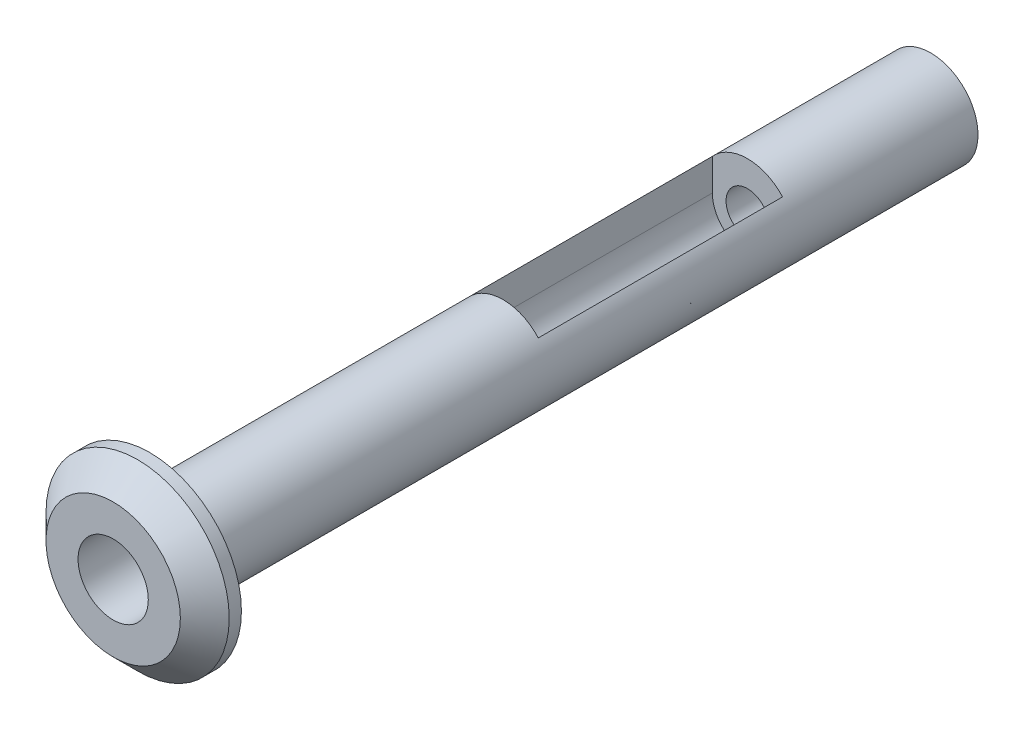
ISO-10303-21;
HEADER;
FILE_DESCRIPTION(('STEP AP214'),'2;1');
FILE_NAME('part.step','',(''),(''),'','','');
FILE_SCHEMA(('AUTOMOTIVE_DESIGN { 1 0 10303 214 1 1 1 1 }'));
ENDSEC;
DATA;
#1=APPLICATION_CONTEXT('core data for automotive mechanical design processes');
#2=APPLICATION_PROTOCOL_DEFINITION('international standard','automotive_design',2000,#1);
#3=PRODUCT_CONTEXT('',#1,'mechanical');
#4=PRODUCT('Part','Part','',(#3));
#5=PRODUCT_RELATED_PRODUCT_CATEGORY('part','',(#4));
#6=PRODUCT_DEFINITION_FORMATION('','',#4);
#7=PRODUCT_DEFINITION_CONTEXT('part definition',#1,'design');
#8=PRODUCT_DEFINITION('design','',#6,#7);
#9=PRODUCT_DEFINITION_SHAPE('','',#8);
#10=(LENGTH_UNIT() NAMED_UNIT(*) SI_UNIT(.MILLI.,.METRE.));
#11=(NAMED_UNIT(*) PLANE_ANGLE_UNIT() SI_UNIT($,.RADIAN.));
#12=(NAMED_UNIT(*) SI_UNIT($,.STERADIAN.) SOLID_ANGLE_UNIT());
#13=UNCERTAINTY_MEASURE_WITH_UNIT(LENGTH_MEASURE(1.E-05),#10,'distance_accuracy_value','');
#14=(GEOMETRIC_REPRESENTATION_CONTEXT(3) GLOBAL_UNCERTAINTY_ASSIGNED_CONTEXT((#13)) GLOBAL_UNIT_ASSIGNED_CONTEXT((#10,
#11,#12)) REPRESENTATION_CONTEXT('',''));
#15=CARTESIAN_POINT('',(0.,0.,0.));
#16=DIRECTION('',(0.,0.,1.));
#17=DIRECTION('',(1.,0.,0.));
#18=AXIS2_PLACEMENT_3D('',#15,#16,#17);
#19=CARTESIAN_POINT('',(0.,0.,-73.5617279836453));
#20=DIRECTION('',(0.,0.,1.));
#21=DIRECTION('',(1.,0.,0.));
#22=AXIS2_PLACEMENT_3D('',#19,#20,#21);
#23=CYLINDRICAL_SURFACE('',#22,2.875);
#24=CARTESIAN_POINT('',(0.,0.,1.5));
#25=DIRECTION('',(0.,0.,1.));
#26=DIRECTION('',(1.,0.,0.));
#27=AXIS2_PLACEMENT_3D('',#24,#25,#26);
#28=CIRCLE('',#27,2.875);
#29=CARTESIAN_POINT('',(2.875,0.,1.5));
#30=VERTEX_POINT('',#29);
#31=EDGE_CURVE('E97',#30,#30,#28,.T.);
#32=ORIENTED_EDGE('',*,*,#31,.T.);
#33=EDGE_LOOP('',(#32));
#34=FACE_BOUND('',#33,.T.);
#35=DIRECTION('',(0.,0.,-1.));
#36=VECTOR('',#35,1.);
#37=CARTESIAN_POINT('',(-2.875,0.,-30.43));
#38=LINE('',#37,#36);
#39=CARTESIAN_POINT('',(-2.875,0.,-30.43));
#40=VERTEX_POINT('',#39);
#41=CARTESIAN_POINT('',(-2.875,0.,-50.43));
#42=VERTEX_POINT('',#41);
#43=EDGE_CURVE('E64',#40,#42,#38,.T.);
#44=ORIENTED_EDGE('',*,*,#43,.F.);
#45=CARTESIAN_POINT('',(0.,0.,-30.43));
#46=DIRECTION('',(0.,0.,1.));
#47=DIRECTION('',(1.,0.,0.));
#48=AXIS2_PLACEMENT_3D('',#45,#46,#47);
#49=CIRCLE('',#48,2.875);
#50=CARTESIAN_POINT('',(2.875,0.,-30.43));
#51=VERTEX_POINT('',#50);
#52=EDGE_CURVE('E12',#40,#51,#49,.F.);
#53=ORIENTED_EDGE('',*,*,#52,.T.);
#54=DIRECTION('',(0.,0.,-1.));
#55=VECTOR('',#54,1.);
#56=CARTESIAN_POINT('',(2.875,0.,-30.43));
#57=LINE('',#56,#55);
#58=CARTESIAN_POINT('',(2.875,0.,-50.43));
#59=VERTEX_POINT('',#58);
#60=EDGE_CURVE('E110',#51,#59,#57,.T.);
#61=ORIENTED_EDGE('',*,*,#60,.T.);
#62=CARTESIAN_POINT('',(0.,0.,-50.43));
#63=DIRECTION('',(0.,0.,-1.));
#64=DIRECTION('',(-1.,0.,0.));
#65=AXIS2_PLACEMENT_3D('',#62,#63,#64);
#66=CIRCLE('',#65,2.875);
#67=EDGE_CURVE('E116',#42,#59,#66,.F.);
#68=ORIENTED_EDGE('',*,*,#67,.F.);
#69=EDGE_LOOP('',(#44,#53,#61,#68));
#70=FACE_BOUND('',#69,.T.);
#71=ADVANCED_FACE('F40',(#34,#70),#23,.F.);
#72=CARTESIAN_POINT('',(0.,0.,-1.5));
#73=DIRECTION('',(0.,0.,1.));
#74=DIRECTION('',(1.,0.,0.));
#75=AXIS2_PLACEMENT_3D('',#72,#73,#74);
#76=PLANE('',#75);
#77=CARTESIAN_POINT('',(0.,0.,-1.5));
#78=DIRECTION('',(0.,0.,1.));
#79=DIRECTION('',(1.,0.,0.));
#80=AXIS2_PLACEMENT_3D('',#77,#78,#79);
#81=CIRCLE('',#80,7.5);
#82=CARTESIAN_POINT('',(7.5,0.,-1.5));
#83=VERTEX_POINT('',#82);
#84=EDGE_CURVE('E126',#83,#83,#81,.T.);
#85=ORIENTED_EDGE('',*,*,#84,.F.);
#86=EDGE_LOOP('',(#85));
#87=FACE_BOUND('',#86,.T.);
#88=CARTESIAN_POINT('',(0.,0.,-1.5));
#89=DIRECTION('',(0.,0.,1.));
#90=DIRECTION('',(1.,0.,0.));
#91=AXIS2_PLACEMENT_3D('',#88,#89,#90);
#92=CIRCLE('',#91,3.875);
#93=CARTESIAN_POINT('',(3.875,0.,-1.5));
#94=VERTEX_POINT('',#93);
#95=EDGE_CURVE('E49',#94,#94,#92,.F.);
#96=ORIENTED_EDGE('',*,*,#95,.F.);
#97=EDGE_LOOP('',(#96));
#98=FACE_BOUND('',#97,.T.);
#99=ADVANCED_FACE('F161',(#87,#98),#76,.F.);
#100=CARTESIAN_POINT('',(0.,0.,1.5));
#101=DIRECTION('',(0.,0.,1.));
#102=DIRECTION('',(1.,0.,0.));
#103=AXIS2_PLACEMENT_3D('',#100,#101,#102);
#104=PLANE('',#103);
#105=ORIENTED_EDGE('',*,*,#31,.F.);
#106=EDGE_LOOP('',(#105));
#107=FACE_BOUND('',#106,.T.);
#108=CARTESIAN_POINT('',(0.,0.,1.5));
#109=DIRECTION('',(0.,0.,1.));
#110=DIRECTION('',(1.,0.,0.));
#111=AXIS2_PLACEMENT_3D('',#108,#109,#110);
#112=CIRCLE('',#111,5.5);
#113=CARTESIAN_POINT('',(5.5,0.,1.5));
#114=VERTEX_POINT('',#113);
#115=EDGE_CURVE('E129',#114,#114,#112,.T.);
#116=ORIENTED_EDGE('',*,*,#115,.T.);
#117=EDGE_LOOP('',(#116));
#118=FACE_BOUND('',#117,.T.);
#119=ADVANCED_FACE('F167',(#107,#118),#104,.T.);
#120=CARTESIAN_POINT('',(0.,0.,1.5));
#121=DIRECTION('',(0.,0.,-1.));
#122=DIRECTION('',(-1.,0.,0.));
#123=AXIS2_PLACEMENT_3D('',#120,#121,#122);
#124=CYLINDRICAL_SURFACE('',#123,7.5);
#125=CARTESIAN_POINT('',(0.,0.,-0.500000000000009));
#126=DIRECTION('',(0.,0.,1.));
#127=DIRECTION('',(1.,0.,0.));
#128=AXIS2_PLACEMENT_3D('',#125,#126,#127);
#129=CIRCLE('',#128,7.5);
#130=CARTESIAN_POINT('',(7.5,0.,-0.500000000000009));
#131=VERTEX_POINT('',#130);
#132=EDGE_CURVE('E132',#131,#131,#129,.F.);
#133=ORIENTED_EDGE('',*,*,#132,.T.);
#134=EDGE_LOOP('',(#133));
#135=FACE_BOUND('',#134,.T.);
#136=ORIENTED_EDGE('',*,*,#84,.T.);
#137=EDGE_LOOP('',(#136));
#138=FACE_BOUND('',#137,.T.);
#139=ADVANCED_FACE('F145',(#135,#138),#124,.T.);
#140=CARTESIAN_POINT('',(0.,0.,1.5));
#141=DIRECTION('',(0.,0.,-1.));
#142=DIRECTION('',(-1.,0.,0.));
#143=AXIS2_PLACEMENT_3D('',#140,#141,#142);
#144=CYLINDRICAL_SURFACE('',#143,1.75);
#145=CARTESIAN_POINT('',(0.,0.,-50.43));
#146=DIRECTION('',(0.,0.,-1.));
#147=DIRECTION('',(-1.,0.,0.));
#148=AXIS2_PLACEMENT_3D('',#145,#146,#147);
#149=CIRCLE('',#148,1.75);
#150=CARTESIAN_POINT('',(-1.75,0.,-50.43));
#151=VERTEX_POINT('',#150);
#152=EDGE_CURVE('E119',#151,#151,#149,.T.);
#153=ORIENTED_EDGE('',*,*,#152,.F.);
#154=EDGE_LOOP('',(#153));
#155=FACE_BOUND('',#154,.T.);
#156=CARTESIAN_POINT('',(0.,0.,-65.43));
#157=DIRECTION('',(0.,0.,-1.));
#158=DIRECTION('',(-1.,0.,0.));
#159=AXIS2_PLACEMENT_3D('',#156,#157,#158);
#160=CIRCLE('',#159,1.75);
#161=CARTESIAN_POINT('',(-1.75,0.,-65.43));
#162=VERTEX_POINT('',#161);
#163=EDGE_CURVE('E120',#162,#162,#160,.T.);
#164=ORIENTED_EDGE('',*,*,#163,.T.);
#165=EDGE_LOOP('',(#164));
#166=FACE_BOUND('',#165,.T.);
#167=ADVANCED_FACE('F142',(#155,#166),#144,.F.);
#168=CARTESIAN_POINT('',(0.,0.,1.5));
#169=DIRECTION('',(0.,0.,-1.));
#170=DIRECTION('',(-1.,0.,0.));
#171=AXIS2_PLACEMENT_3D('',#168,#169,#170);
#172=CONICAL_SURFACE('',#171,5.5,0.785398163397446);
#173=ORIENTED_EDGE('',*,*,#132,.F.);
#174=EDGE_LOOP('',(#173));
#175=FACE_BOUND('',#174,.T.);
#176=ORIENTED_EDGE('',*,*,#115,.F.);
#177=EDGE_LOOP('',(#176));
#178=FACE_BOUND('',#177,.T.);
#179=ADVANCED_FACE('F43',(#175,#178),#172,.T.);
#180=CARTESIAN_POINT('',(0.,0.,-65.43));
#181=DIRECTION('',(0.,0.,-1.));
#182=DIRECTION('',(-1.,0.,0.));
#183=AXIS2_PLACEMENT_3D('',#180,#181,#182);
#184=PLANE('',#183);
#185=CARTESIAN_POINT('',(0.,0.,-65.43));
#186=DIRECTION('',(0.,0.,-1.));
#187=DIRECTION('',(-1.,0.,0.));
#188=AXIS2_PLACEMENT_3D('',#185,#186,#187);
#189=CIRCLE('',#188,3.875);
#190=CARTESIAN_POINT('',(-3.875,0.,-65.43));
#191=VERTEX_POINT('',#190);
#192=EDGE_CURVE('E123',#191,#191,#189,.T.);
#193=ORIENTED_EDGE('',*,*,#192,.T.);
#194=EDGE_LOOP('',(#193));
#195=FACE_BOUND('',#194,.T.);
#196=ORIENTED_EDGE('',*,*,#163,.F.);
#197=EDGE_LOOP('',(#196));
#198=FACE_BOUND('',#197,.T.);
#199=ADVANCED_FACE('F149',(#195,#198),#184,.T.);
#200=CARTESIAN_POINT('',(0.,0.,-65.43));
#201=DIRECTION('',(0.,0.,1.));
#202=DIRECTION('',(1.,0.,0.));
#203=AXIS2_PLACEMENT_3D('',#200,#201,#202);
#204=CYLINDRICAL_SURFACE('',#203,3.875);
#205=DIRECTION('',(0.,0.,-1.));
#206=VECTOR('',#205,1.);
#207=CARTESIAN_POINT('',(2.875,2.59807621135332,-30.43));
#208=LINE('',#207,#206);
#209=CARTESIAN_POINT('',(2.875,2.59807621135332,-30.43));
#210=VERTEX_POINT('',#209);
#211=CARTESIAN_POINT('',(2.875,2.59807621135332,-50.43));
#212=VERTEX_POINT('',#211);
#213=EDGE_CURVE('E56',#210,#212,#208,.T.);
#214=ORIENTED_EDGE('',*,*,#213,.F.);
#215=CARTESIAN_POINT('',(0.,0.,-30.43));
#216=DIRECTION('',(0.,0.,1.));
#217=DIRECTION('',(1.,0.,0.));
#218=AXIS2_PLACEMENT_3D('',#215,#216,#217);
#219=CIRCLE('',#218,3.875);
#220=CARTESIAN_POINT('',(-2.875,2.59807621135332,-30.43));
#221=VERTEX_POINT('',#220);
#222=EDGE_CURVE('E87',#210,#221,#219,.T.);
#223=ORIENTED_EDGE('',*,*,#222,.T.);
#224=DIRECTION('',(0.,0.,-1.));
#225=VECTOR('',#224,1.);
#226=CARTESIAN_POINT('',(-2.875,2.59807621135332,-30.43));
#227=LINE('',#226,#225);
#228=CARTESIAN_POINT('',(-2.875,2.59807621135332,-50.43));
#229=VERTEX_POINT('',#228);
#230=EDGE_CURVE('E91',#221,#229,#227,.T.);
#231=ORIENTED_EDGE('',*,*,#230,.T.);
#232=CARTESIAN_POINT('',(0.,0.,-50.43));
#233=DIRECTION('',(0.,0.,1.));
#234=DIRECTION('',(1.,0.,0.));
#235=AXIS2_PLACEMENT_3D('',#232,#233,#234);
#236=CIRCLE('',#235,3.875);
#237=EDGE_CURVE('E106',#212,#229,#236,.T.);
#238=ORIENTED_EDGE('',*,*,#237,.F.);
#239=EDGE_LOOP('',(#214,#223,#231,#238));
#240=FACE_BOUND('',#239,.T.);
#241=ORIENTED_EDGE('',*,*,#192,.F.);
#242=EDGE_LOOP('',(#241));
#243=FACE_BOUND('',#242,.T.);
#244=ORIENTED_EDGE('',*,*,#95,.T.);
#245=EDGE_LOOP('',(#244));
#246=FACE_BOUND('',#245,.T.);
#247=ADVANCED_FACE('F99',(#240,#243,#246),#204,.T.);
#248=CARTESIAN_POINT('',(0.,0.,-50.43));
#249=DIRECTION('',(0.,0.,-1.));
#250=DIRECTION('',(-1.,0.,0.));
#251=AXIS2_PLACEMENT_3D('',#248,#249,#250);
#252=PLANE('',#251);
#253=ORIENTED_EDGE('',*,*,#152,.T.);
#254=EDGE_LOOP('',(#253));
#255=FACE_BOUND('',#254,.T.);
#256=DIRECTION('',(0.,-1.,0.));
#257=VECTOR('',#256,1.);
#258=CARTESIAN_POINT('',(-2.875,2.59807621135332,-50.43));
#259=LINE('',#258,#257);
#260=EDGE_CURVE('E93',#229,#42,#259,.T.);
#261=ORIENTED_EDGE('',*,*,#260,.T.);
#262=ORIENTED_EDGE('',*,*,#67,.T.);
#263=DIRECTION('',(0.,1.,0.));
#264=VECTOR('',#263,1.);
#265=CARTESIAN_POINT('',(2.875,0.,-50.43));
#266=LINE('',#265,#264);
#267=EDGE_CURVE('E101',#59,#212,#266,.T.);
#268=ORIENTED_EDGE('',*,*,#267,.T.);
#269=ORIENTED_EDGE('',*,*,#237,.T.);
#270=EDGE_LOOP('',(#261,#262,#268,#269));
#271=FACE_BOUND('',#270,.T.);
#272=ADVANCED_FACE('F139',(#255,#271),#252,.F.);
#273=CARTESIAN_POINT('',(0.,0.,-30.43));
#274=DIRECTION('',(0.,0.,1.));
#275=DIRECTION('',(1.,0.,0.));
#276=AXIS2_PLACEMENT_3D('',#273,#274,#275);
#277=PLANE('',#276);
#278=DIRECTION('',(0.,-1.,0.));
#279=VECTOR('',#278,1.);
#280=CARTESIAN_POINT('',(-2.875,2.59807621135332,-30.43));
#281=LINE('',#280,#279);
#282=EDGE_CURVE('E82',#221,#40,#281,.T.);
#283=ORIENTED_EDGE('',*,*,#282,.F.);
#284=ORIENTED_EDGE('',*,*,#222,.F.);
#285=DIRECTION('',(0.,1.,0.));
#286=VECTOR('',#285,1.);
#287=CARTESIAN_POINT('',(2.875,0.,-30.43));
#288=LINE('',#287,#286);
#289=EDGE_CURVE('E88',#51,#210,#288,.T.);
#290=ORIENTED_EDGE('',*,*,#289,.F.);
#291=ORIENTED_EDGE('',*,*,#52,.F.);
#292=EDGE_LOOP('',(#283,#284,#290,#291));
#293=FACE_BOUND('',#292,.T.);
#294=ADVANCED_FACE('F84',(#293),#277,.F.);
#295=CARTESIAN_POINT('',(-2.875,2.59807621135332,-30.43));
#296=DIRECTION('',(1.,0.,0.));
#297=DIRECTION('',(0.,0.,-1.));
#298=AXIS2_PLACEMENT_3D('',#295,#296,#297);
#299=PLANE('',#298);
#300=ORIENTED_EDGE('',*,*,#260,.F.);
#301=ORIENTED_EDGE('',*,*,#230,.F.);
#302=ORIENTED_EDGE('',*,*,#282,.T.);
#303=ORIENTED_EDGE('',*,*,#43,.T.);
#304=EDGE_LOOP('',(#300,#301,#302,#303));
#305=FACE_BOUND('',#304,.T.);
#306=ADVANCED_FACE('F92',(#305),#299,.T.);
#307=CARTESIAN_POINT('',(2.875,0.,-30.43));
#308=DIRECTION('',(-1.,0.,0.));
#309=DIRECTION('',(0.,0.,1.));
#310=AXIS2_PLACEMENT_3D('',#307,#308,#309);
#311=PLANE('',#310);
#312=ORIENTED_EDGE('',*,*,#267,.F.);
#313=ORIENTED_EDGE('',*,*,#60,.F.);
#314=ORIENTED_EDGE('',*,*,#289,.T.);
#315=ORIENTED_EDGE('',*,*,#213,.T.);
#316=EDGE_LOOP('',(#312,#313,#314,#315));
#317=FACE_BOUND('',#316,.T.);
#318=ADVANCED_FACE('F181',(#317),#311,.T.);
#319=CLOSED_SHELL('',(#71,#99,#119,#139,#167,#179,#199,#247,#272,#294,#306,#318));
#320=MANIFOLD_SOLID_BREP('B2',#319);
#321=ADVANCED_BREP_SHAPE_REPRESENTATION('',(#18,#320),#14);
#322=SHAPE_DEFINITION_REPRESENTATION(#9,#321);
ENDSEC;
END-ISO-10303-21;
